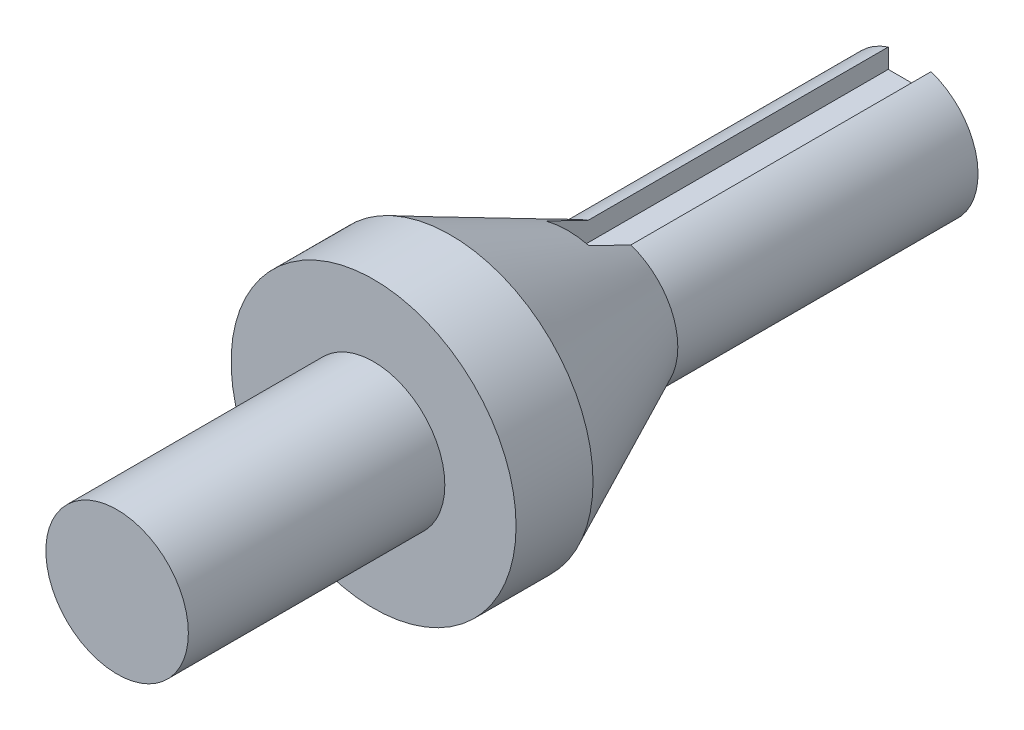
ISO-10303-21;
HEADER;
FILE_DESCRIPTION(('STEP AP214'),'2;1');
FILE_NAME('part.step','',(''),(''),'','','');
FILE_SCHEMA(('AUTOMOTIVE_DESIGN { 1 0 10303 214 1 1 1 1 }'));
ENDSEC;
DATA;
#1=APPLICATION_CONTEXT('core data for automotive mechanical design processes');
#2=APPLICATION_PROTOCOL_DEFINITION('international standard','automotive_design',2000,#1);
#3=PRODUCT_CONTEXT('',#1,'mechanical');
#4=PRODUCT('Part','Part','',(#3));
#5=PRODUCT_RELATED_PRODUCT_CATEGORY('part','',(#4));
#6=PRODUCT_DEFINITION_FORMATION('','',#4);
#7=PRODUCT_DEFINITION_CONTEXT('part definition',#1,'design');
#8=PRODUCT_DEFINITION('design','',#6,#7);
#9=PRODUCT_DEFINITION_SHAPE('','',#8);
#10=(LENGTH_UNIT() NAMED_UNIT(*) SI_UNIT(.MILLI.,.METRE.));
#11=(NAMED_UNIT(*) PLANE_ANGLE_UNIT() SI_UNIT($,.RADIAN.));
#12=(NAMED_UNIT(*) SI_UNIT($,.STERADIAN.) SOLID_ANGLE_UNIT());
#13=UNCERTAINTY_MEASURE_WITH_UNIT(LENGTH_MEASURE(1.E-05),#10,'distance_accuracy_value','');
#14=(GEOMETRIC_REPRESENTATION_CONTEXT(3) GLOBAL_UNCERTAINTY_ASSIGNED_CONTEXT((#13)) GLOBAL_UNIT_ASSIGNED_CONTEXT((#10,
#11,#12)) REPRESENTATION_CONTEXT('',''));
#15=CARTESIAN_POINT('',(0.,0.,0.));
#16=DIRECTION('',(0.,0.,1.));
#17=DIRECTION('',(1.,0.,0.));
#18=AXIS2_PLACEMENT_3D('',#15,#16,#17);
#19=CARTESIAN_POINT('',(0.,0.,13.905));
#20=DIRECTION('',(0.,0.,-1.));
#21=DIRECTION('',(-1.,0.,0.));
#22=AXIS2_PLACEMENT_3D('',#19,#20,#21);
#23=PLANE('',#22);
#24=CARTESIAN_POINT('',(0.,0.,13.905));
#25=DIRECTION('',(0.,0.,1.));
#26=DIRECTION('',(1.,0.,0.));
#27=AXIS2_PLACEMENT_3D('',#24,#25,#26);
#28=CIRCLE('',#27,2.5);
#29=CARTESIAN_POINT('',(2.5,0.,13.905));
#30=VERTEX_POINT('',#29);
#31=EDGE_CURVE('E172',#30,#30,#28,.T.);
#32=ORIENTED_EDGE('',*,*,#31,.T.);
#33=EDGE_LOOP('',(#32));
#34=FACE_BOUND('',#33,.T.);
#35=ADVANCED_FACE('F39',(#34),#23,.F.);
#36=CARTESIAN_POINT('',(0.,0.,14.4822971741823));
#37=DIRECTION('',(0.,0.,1.));
#38=DIRECTION('',(1.,0.,0.));
#39=AXIS2_PLACEMENT_3D('',#36,#37,#38);
#40=CYLINDRICAL_SURFACE('',#39,2.5);
#41=ORIENTED_EDGE('',*,*,#31,.F.);
#42=EDGE_LOOP('',(#41));
#43=FACE_BOUND('',#42,.T.);
#44=CARTESIAN_POINT('',(0.,0.,4.905));
#45=DIRECTION('',(0.,0.,1.));
#46=DIRECTION('',(1.,0.,0.));
#47=AXIS2_PLACEMENT_3D('',#44,#45,#46);
#48=CIRCLE('',#47,2.5);
#49=CARTESIAN_POINT('',(2.5,0.,4.905));
#50=VERTEX_POINT('',#49);
#51=EDGE_CURVE('E168',#50,#50,#48,.T.);
#52=ORIENTED_EDGE('',*,*,#51,.T.);
#53=EDGE_LOOP('',(#52));
#54=FACE_BOUND('',#53,.T.);
#55=ADVANCED_FACE('F196',(#43,#54),#40,.T.);
#56=CARTESIAN_POINT('',(0.,2.5,4.905));
#57=DIRECTION('',(0.,0.,-1.));
#58=DIRECTION('',(-1.,0.,0.));
#59=AXIS2_PLACEMENT_3D('',#56,#57,#58);
#60=PLANE('',#59);
#61=ORIENTED_EDGE('',*,*,#51,.F.);
#62=EDGE_LOOP('',(#61));
#63=FACE_BOUND('',#62,.T.);
#64=CARTESIAN_POINT('',(0.,0.,4.905));
#65=DIRECTION('',(0.,0.,1.));
#66=DIRECTION('',(1.,0.,0.));
#67=AXIS2_PLACEMENT_3D('',#64,#65,#66);
#68=CIRCLE('',#67,5.);
#69=CARTESIAN_POINT('',(5.,0.,4.905));
#70=VERTEX_POINT('',#69);
#71=EDGE_CURVE('E164',#70,#70,#68,.T.);
#72=ORIENTED_EDGE('',*,*,#71,.T.);
#73=EDGE_LOOP('',(#72));
#74=FACE_BOUND('',#73,.T.);
#75=ADVANCED_FACE('F192',(#63,#74),#60,.F.);
#76=CARTESIAN_POINT('',(0.,0.,14.4822971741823));
#77=DIRECTION('',(0.,0.,1.));
#78=DIRECTION('',(1.,0.,0.));
#79=AXIS2_PLACEMENT_3D('',#76,#77,#78);
#80=CYLINDRICAL_SURFACE('',#79,5.);
#81=ORIENTED_EDGE('',*,*,#71,.F.);
#82=EDGE_LOOP('',(#81));
#83=FACE_BOUND('',#82,.T.);
#84=CARTESIAN_POINT('',(0.,0.,2.205));
#85=DIRECTION('',(0.,0.,1.));
#86=DIRECTION('',(1.,0.,0.));
#87=AXIS2_PLACEMENT_3D('',#84,#85,#86);
#88=CIRCLE('',#87,5.);
#89=CARTESIAN_POINT('',(5.,0.,2.205));
#90=VERTEX_POINT('',#89);
#91=EDGE_CURVE('E160',#90,#90,#88,.T.);
#92=ORIENTED_EDGE('',*,*,#91,.T.);
#93=EDGE_LOOP('',(#92));
#94=FACE_BOUND('',#93,.T.);
#95=ADVANCED_FACE('F186',(#83,#94),#80,.T.);
#96=CARTESIAN_POINT('',(0.,0.,-3.37071799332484));
#97=DIRECTION('',(0.,0.,1.));
#98=DIRECTION('',(1.,0.,0.));
#99=AXIS2_PLACEMENT_3D('',#96,#97,#98);
#100=CONICAL_SURFACE('',#99,2.4,0.436332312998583);
#101=ORIENTED_EDGE('',*,*,#91,.F.);
#102=EDGE_LOOP('',(#101));
#103=FACE_BOUND('',#102,.T.);
#104=CARTESIAN_POINT('',(0.,0.,-1.905));
#105=DIRECTION('',(0.,0.,-1.));
#106=DIRECTION('',(-1.,0.,0.));
#107=AXIS2_PLACEMENT_3D('',#104,#105,#106);
#108=CIRCLE('',#107,3.08347552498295);
#109=CARTESIAN_POINT('',(-0.75,2.99087300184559,-1.905));
#110=VERTEX_POINT('',#109);
#111=CARTESIAN_POINT('',(0.75,2.99087300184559,-1.905));
#112=VERTEX_POINT('',#111);
#113=EDGE_CURVE('E11',#110,#112,#108,.T.);
#114=ORIENTED_EDGE('',*,*,#113,.F.);
#115=CARTESIAN_POINT('',(-0.75,3.99167014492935,0.192419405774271));
#116=CARTESIAN_POINT('',(-0.75,3.87898976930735,-0.0450523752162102));
#117=CARTESIAN_POINT('',(-0.75,3.76618854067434,-0.282467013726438));
#118=CARTESIAN_POINT('',(-0.75,3.54023900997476,-0.757127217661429));
#119=CARTESIAN_POINT('',(-0.75,3.42709071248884,-0.99437278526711));
#120=CARTESIAN_POINT('',(-0.75,3.20035190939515,-1.46861871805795));
#121=CARTESIAN_POINT('',(-0.75,3.08676145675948,-1.70561910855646));
#122=CARTESIAN_POINT('',(-0.75,2.8589506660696,-2.17932165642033));
#123=CARTESIAN_POINT('',(-0.75,2.74473031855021,-2.41602380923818));
#124=CARTESIAN_POINT('',(-0.75,2.51537101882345,-2.8890304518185));
#125=CARTESIAN_POINT('',(-0.75,2.40023192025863,-3.12533487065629));
#126=CARTESIAN_POINT('',(-0.75,2.16861275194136,-3.59727757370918));
#127=CARTESIAN_POINT('',(-0.75,2.0521327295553,-3.8329158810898));
#128=CARTESIAN_POINT('',(-0.75,1.87575590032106,-4.18556874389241));
#129=CARTESIAN_POINT('',(-0.75,1.81668274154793,-4.30299487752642));
#130=CARTESIAN_POINT('',(-0.75,1.69780296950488,-4.53747315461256));
#131=CARTESIAN_POINT('',(-0.75,1.63799636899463,-4.65452530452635));
#132=CARTESIAN_POINT('',(-0.75,1.51738303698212,-4.88813290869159));
#133=CARTESIAN_POINT('',(-0.75,1.45657618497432,-5.0046883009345));
#134=CARTESIAN_POINT('',(-0.75,1.36430839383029,-5.17896626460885));
#135=CARTESIAN_POINT('',(-0.75,1.33337528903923,-5.23696809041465));
#136=CARTESIAN_POINT('',(-0.75,1.27107477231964,-5.35273923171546));
#137=CARTESIAN_POINT('',(-0.75,1.23970735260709,-5.41050854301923));
#138=CARTESIAN_POINT('',(-0.75,1.20808214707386,-5.46813739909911));
#139=B_SPLINE_CURVE_WITH_KNOTS('',3,(#115,#116,#117,#118,#119,#120,#121,#122,#123,#124,#125,
#126,#127,#128,#129,#130,#131,#132,#133,#134,#135,#136,#137,#138),.UNSPECIFIED.,.F.,.F.,(4,2,2,
2,2,2,2,2,2,2,2,4),(0.,0.788547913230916,1.57708546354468,2.36553128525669,3.15398898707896,
3.94257490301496,4.73113304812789,5.12547466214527,5.51980942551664,5.91419204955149,
6.11139492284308,6.30860133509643),.UNSPECIFIED.);
#140=CARTESIAN_POINT('',(-0.75,2.2798026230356,-3.37071799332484));
#141=VERTEX_POINT('',#140);
#142=EDGE_CURVE('E145',#110,#141,#139,.T.);
#143=ORIENTED_EDGE('',*,*,#142,.T.);
#144=CARTESIAN_POINT('',(0.,0.,-3.37071799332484));
#145=DIRECTION('',(0.,0.,1.));
#146=DIRECTION('',(1.,0.,0.));
#147=AXIS2_PLACEMENT_3D('',#144,#145,#146);
#148=CIRCLE('',#147,2.4);
#149=CARTESIAN_POINT('',(0.75,2.2798026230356,-3.37071799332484));
#150=VERTEX_POINT('',#149);
#151=EDGE_CURVE('E156',#141,#150,#148,.T.);
#152=ORIENTED_EDGE('',*,*,#151,.T.);
#153=CARTESIAN_POINT('',(0.750000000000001,1.20808214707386,-5.46813739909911));
#154=CARTESIAN_POINT('',(0.750000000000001,1.24817392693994,-5.39506979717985));
#155=CARTESIAN_POINT('',(0.750000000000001,1.28785778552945,-5.3217805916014));
#156=CARTESIAN_POINT('',(0.750000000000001,1.3665613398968,-5.17484882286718));
#157=CARTESIAN_POINT('',(0.750000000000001,1.40558105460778,-5.10120626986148));
#158=CARTESIAN_POINT('',(0.750000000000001,1.52186835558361,-4.87988949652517));
#159=CARTESIAN_POINT('',(0.750000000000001,1.59837079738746,-4.73181383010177));
#160=CARTESIAN_POINT('',(0.750000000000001,1.75002654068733,-4.43499994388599));
#161=CARTESIAN_POINT('',(0.75,1.82518001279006,-4.2862618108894));
#162=CARTESIAN_POINT('',(0.75,1.97454817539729,-3.98831044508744));
#163=CARTESIAN_POINT('',(0.75,2.04876284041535,-3.83909719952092));
#164=CARTESIAN_POINT('',(0.75,2.28180342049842,-3.36791499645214));
#165=CARTESIAN_POINT('',(0.75,2.43941285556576,-3.04534512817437));
#166=CARTESIAN_POINT('',(0.75,2.75292807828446,-2.39938246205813));
#167=CARTESIAN_POINT('',(0.75,2.90883386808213,-2.07598966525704));
#168=CARTESIAN_POINT('',(0.75,3.2196260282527,-1.42861385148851));
#169=CARTESIAN_POINT('',(0.75,3.37451212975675,-1.10463070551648));
#170=CARTESIAN_POINT('',(0.75,3.6835546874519,-0.456322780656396));
#171=CARTESIAN_POINT('',(0.75,3.83771115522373,-0.131998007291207));
#172=CARTESIAN_POINT('',(0.75,3.99167014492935,0.192419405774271));
#173=B_SPLINE_CURVE_WITH_KNOTS('',3,(#153,#154,#155,#156,#157,#158,#159,#160,#161,#162,#163,
#164,#165,#166,#167,#168,#169,#170,#171,#172),.UNSPECIFIED.,.F.,.F.,(4,2,2,2,2,2,2,2,2,4),(0.,
0.250027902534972,0.500048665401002,1.00004809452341,1.4999838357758,1.99993312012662,
3.07696807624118,4.154001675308,5.23130872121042,6.30859861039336),.UNSPECIFIED.);
#174=EDGE_CURVE('E121',#150,#112,#173,.T.);
#175=ORIENTED_EDGE('',*,*,#174,.T.);
#176=EDGE_LOOP('',(#114,#143,#152,#175));
#177=FACE_BOUND('',#176,.T.);
#178=ADVANCED_FACE('F131',(#103,#177),#100,.T.);
#179=CARTESIAN_POINT('',(0.,0.,14.4822971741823));
#180=DIRECTION('',(0.,0.,1.));
#181=DIRECTION('',(1.,0.,0.));
#182=AXIS2_PLACEMENT_3D('',#179,#180,#181);
#183=CYLINDRICAL_SURFACE('',#182,2.4);
#184=ORIENTED_EDGE('',*,*,#151,.F.);
#185=DIRECTION('',(0.,0.,1.));
#186=VECTOR('',#185,1.);
#187=CARTESIAN_POINT('',(-0.75,2.2798026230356,14.4822971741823));
#188=LINE('',#187,#186);
#189=CARTESIAN_POINT('',(-0.75,2.2798026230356,-13.905));
#190=VERTEX_POINT('',#189);
#191=EDGE_CURVE('E62',#141,#190,#188,.F.);
#192=ORIENTED_EDGE('',*,*,#191,.T.);
#193=CARTESIAN_POINT('',(0.,0.,-13.905));
#194=DIRECTION('',(0.,0.,1.));
#195=DIRECTION('',(1.,0.,0.));
#196=AXIS2_PLACEMENT_3D('',#193,#194,#195);
#197=CIRCLE('',#196,2.4);
#198=CARTESIAN_POINT('',(0.75,2.2798026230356,-13.905));
#199=VERTEX_POINT('',#198);
#200=EDGE_CURVE('E152',#190,#199,#197,.T.);
#201=ORIENTED_EDGE('',*,*,#200,.T.);
#202=DIRECTION('',(0.,0.,1.));
#203=VECTOR('',#202,1.);
#204=CARTESIAN_POINT('',(0.75,2.2798026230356,14.4822971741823));
#205=LINE('',#204,#203);
#206=EDGE_CURVE('E54',#199,#150,#205,.T.);
#207=ORIENTED_EDGE('',*,*,#206,.T.);
#208=EDGE_LOOP('',(#184,#192,#201,#207));
#209=FACE_BOUND('',#208,.T.);
#210=ADVANCED_FACE('F181',(#209),#183,.T.);
#211=CARTESIAN_POINT('',(0.,2.4,-13.905));
#212=DIRECTION('',(0.,0.,1.));
#213=DIRECTION('',(1.,0.,0.));
#214=AXIS2_PLACEMENT_3D('',#211,#212,#213);
#215=PLANE('',#214);
#216=ORIENTED_EDGE('',*,*,#200,.F.);
#217=DIRECTION('',(0.,1.,0.));
#218=VECTOR('',#217,1.);
#219=CARTESIAN_POINT('',(-0.75,3.1,-13.905));
#220=LINE('',#219,#218);
#221=CARTESIAN_POINT('',(-0.75,1.6,-13.905));
#222=VERTEX_POINT('',#221);
#223=EDGE_CURVE('E111',#222,#190,#220,.T.);
#224=ORIENTED_EDGE('',*,*,#223,.F.);
#225=DIRECTION('',(-1.,0.,0.));
#226=VECTOR('',#225,1.);
#227=CARTESIAN_POINT('',(0.750000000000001,1.6,-13.905));
#228=LINE('',#227,#226);
#229=CARTESIAN_POINT('',(0.750000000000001,1.6,-13.905));
#230=VERTEX_POINT('',#229);
#231=EDGE_CURVE('E114',#230,#222,#228,.T.);
#232=ORIENTED_EDGE('',*,*,#231,.F.);
#233=DIRECTION('',(0.,1.,0.));
#234=VECTOR('',#233,1.);
#235=CARTESIAN_POINT('',(0.75,2.4,-13.905));
#236=LINE('',#235,#234);
#237=EDGE_CURVE('E47',#230,#199,#236,.T.);
#238=ORIENTED_EDGE('',*,*,#237,.T.);
#239=EDGE_LOOP('',(#216,#224,#232,#238));
#240=FACE_BOUND('',#239,.T.);
#241=ADVANCED_FACE('F144',(#240),#215,.F.);
#242=CARTESIAN_POINT('',(0.,0.,-1.905));
#243=DIRECTION('',(0.,0.,-1.));
#244=DIRECTION('',(-1.,0.,0.));
#245=AXIS2_PLACEMENT_3D('',#242,#243,#244);
#246=PLANE('',#245);
#247=ORIENTED_EDGE('',*,*,#113,.T.);
#248=DIRECTION('',(0.,-1.,0.));
#249=VECTOR('',#248,1.);
#250=CARTESIAN_POINT('',(0.75,3.1,-1.905));
#251=LINE('',#250,#249);
#252=CARTESIAN_POINT('',(0.750000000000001,1.6,-1.905));
#253=VERTEX_POINT('',#252);
#254=EDGE_CURVE('E85',#112,#253,#251,.T.);
#255=ORIENTED_EDGE('',*,*,#254,.T.);
#256=DIRECTION('',(-1.,0.,0.));
#257=VECTOR('',#256,1.);
#258=CARTESIAN_POINT('',(0.750000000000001,1.6,-1.905));
#259=LINE('',#258,#257);
#260=CARTESIAN_POINT('',(-0.75,1.6,-1.905));
#261=VERTEX_POINT('',#260);
#262=EDGE_CURVE('E90',#253,#261,#259,.T.);
#263=ORIENTED_EDGE('',*,*,#262,.T.);
#264=DIRECTION('',(0.,1.,0.));
#265=VECTOR('',#264,1.);
#266=CARTESIAN_POINT('',(-0.75,3.1,-1.905));
#267=LINE('',#266,#265);
#268=EDGE_CURVE('E94',#261,#110,#267,.T.);
#269=ORIENTED_EDGE('',*,*,#268,.T.);
#270=EDGE_LOOP('',(#247,#255,#263,#269));
#271=FACE_BOUND('',#270,.T.);
#272=ADVANCED_FACE('F87',(#271),#246,.T.);
#273=CARTESIAN_POINT('',(-0.75,3.1,-1.905));
#274=DIRECTION('',(-1.,0.,0.));
#275=DIRECTION('',(0.,-1.,0.));
#276=AXIS2_PLACEMENT_3D('',#273,#274,#275);
#277=PLANE('',#276);
#278=ORIENTED_EDGE('',*,*,#268,.F.);
#279=DIRECTION('',(0.,0.,-1.));
#280=VECTOR('',#279,1.);
#281=CARTESIAN_POINT('',(-0.75,1.6,-1.905));
#282=LINE('',#281,#280);
#283=EDGE_CURVE('E103',#261,#222,#282,.T.);
#284=ORIENTED_EDGE('',*,*,#283,.T.);
#285=ORIENTED_EDGE('',*,*,#223,.T.);
#286=ORIENTED_EDGE('',*,*,#191,.F.);
#287=ORIENTED_EDGE('',*,*,#142,.F.);
#288=EDGE_LOOP('',(#278,#284,#285,#286,#287));
#289=FACE_BOUND('',#288,.T.);
#290=ADVANCED_FACE('F139',(#289),#277,.F.);
#291=CARTESIAN_POINT('',(0.75,3.1,-1.905));
#292=DIRECTION('',(1.,0.,0.));
#293=DIRECTION('',(0.,1.,0.));
#294=AXIS2_PLACEMENT_3D('',#291,#292,#293);
#295=PLANE('',#294);
#296=ORIENTED_EDGE('',*,*,#206,.F.);
#297=ORIENTED_EDGE('',*,*,#237,.F.);
#298=DIRECTION('',(0.,0.,-1.));
#299=VECTOR('',#298,1.);
#300=CARTESIAN_POINT('',(0.750000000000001,1.6,-1.905));
#301=LINE('',#300,#299);
#302=EDGE_CURVE('E97',#253,#230,#301,.T.);
#303=ORIENTED_EDGE('',*,*,#302,.F.);
#304=ORIENTED_EDGE('',*,*,#254,.F.);
#305=ORIENTED_EDGE('',*,*,#174,.F.);
#306=EDGE_LOOP('',(#296,#297,#303,#304,#305));
#307=FACE_BOUND('',#306,.T.);
#308=ADVANCED_FACE('F98',(#307),#295,.F.);
#309=CARTESIAN_POINT('',(0.750000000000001,1.6,-1.905));
#310=DIRECTION('',(0.,-1.,0.));
#311=DIRECTION('',(0.,0.,-1.));
#312=AXIS2_PLACEMENT_3D('',#309,#310,#311);
#313=PLANE('',#312);
#314=ORIENTED_EDGE('',*,*,#231,.T.);
#315=ORIENTED_EDGE('',*,*,#283,.F.);
#316=ORIENTED_EDGE('',*,*,#262,.F.);
#317=ORIENTED_EDGE('',*,*,#302,.T.);
#318=EDGE_LOOP('',(#314,#315,#316,#317));
#319=FACE_BOUND('',#318,.T.);
#320=ADVANCED_FACE('F105',(#319),#313,.F.);
#321=CLOSED_SHELL('',(#35,#55,#75,#95,#178,#210,#241,#272,#290,#308,#320));
#322=MANIFOLD_SOLID_BREP('B2',#321);
#323=ADVANCED_BREP_SHAPE_REPRESENTATION('',(#18,#322),#14);
#324=SHAPE_DEFINITION_REPRESENTATION(#9,#323);
ENDSEC;
END-ISO-10303-21;
